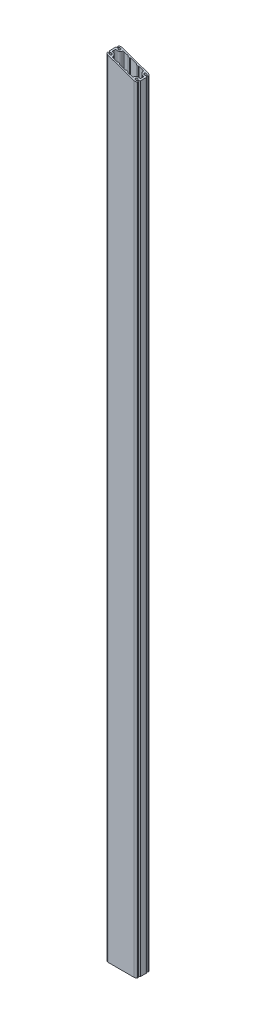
from build123d import *

# Parameters (mm, degrees)
SALIENTE_EXTRUIR1_DEPTH = 4584.8
CORTAR_EXTRUIR1_DEPTH   = 4587.381039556


with BuildPart() as part:
    # Croquis2 → Saliente-Extruir1 (new body)
    with BuildSketch(Plane(origin=(0, 0, 0), x_dir=(1, 0, 0), z_dir=(0, 1, 0))):
        with BuildLine():
            Line((90, -15.820430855), (90, 15.820430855))
            ThreePointArc((90, 15.820430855), (86.377431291, 21.479059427), (79.722019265, 20.557879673))
            ThreePointArc((79.722019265, 20.557879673), (69.104845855, 26.662756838), (81.19143785, 28.639671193))
            ThreePointArc((81.19143785, 28.639671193), (86.625966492, 27.069353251), (88.196284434, 32.503881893))
            ThreePointArc((88.196284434, 32.503881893), (82.872032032, 37.986118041), (75.5, 40))
            Line((75.5, 40), (-75.5, 40))
            ThreePointArc((-75.5, 40), (-82.872032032, 37.986118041), (-88.196284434, 32.503881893))
            ThreePointArc((-88.196284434, 32.503881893), (-86.625966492, 27.069353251), (-81.19143785, 28.639671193))
            ThreePointArc((-81.19143785, 28.639671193), (-69.104845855, 26.662756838), (-79.722019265, 20.557879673))
            ThreePointArc((-79.722019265, 20.557879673), (-86.377431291, 21.479059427), (-90, 15.820430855))
            Line((-90, 15.820430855), (-90, -15.820430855))
            ThreePointArc((-90, -15.820430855), (-86.377431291, -21.479059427), (-79.722019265, -20.557879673))
            ThreePointArc((-79.722019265, -20.557879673), (-69.104845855, -26.662756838), (-81.19143785, -28.639671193))
            ThreePointArc((-81.19143785, -28.639671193), (-86.625966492, -27.069353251), (-88.196284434, -32.503881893))
            ThreePointArc((-88.196284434, -32.503881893), (-82.872032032, -37.986118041), (-75.5, -40))
            Line((-75.5, -40), (75.5, -40))
            ThreePointArc((75.5, -40), (82.872032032, -37.986118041), (88.196284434, -32.503881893))
            ThreePointArc((88.196284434, -32.503881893), (86.625966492, -27.069353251), (81.19143785, -28.639671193))
            ThreePointArc((81.19143785, -28.639671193), (69.104845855, -26.662756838), (79.722019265, -20.557879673))
            ThreePointArc((79.722019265, -20.557879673), (86.377431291, -21.479059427), (90, -15.820430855))
        make_face()
        with BuildLine():
            Line((-17.482701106, 32), (17.482701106, 32))
            Line((17.482701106, 32), (20, 29))
            Line((20, 29), (30, 29))
            Line((30, 29), (32.517298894, 32))
            Line((32.517298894, 32), (54.5, 32))
            ThreePointArc((54.5, 32), (59.096194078, 30.096194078), (61, 25.5))
            ThreePointArc((61, 25.5), (65.246951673, 15.246951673), (75.5, 11))
            ThreePointArc((75.5, 11), (80.096194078, 9.096194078), (82, 4.5))
            Line((82, 4.5), (82, -4.5))
            ThreePointArc((82, -4.5), (80.096194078, -9.096194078), (75.5, -11))
            ThreePointArc((75.5, -11), (65.246951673, -15.246951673), (61, -25.5))
            ThreePointArc((61, -25.5), (59.096194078, -30.096194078), (54.5, -32))
            Line((54.5, -32), (32.517298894, -32))
            Line((32.517298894, -32), (30, -29))
            Line((30, -29), (20, -29))
            Line((20, -29), (17.482701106, -32))
            Line((17.482701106, -32), (-17.482701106, -32))
            Line((-17.482701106, -32), (-20, -29))
            Line((-20, -29), (-30, -29))
            Line((-30, -29), (-32.517298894, -32))
            Line((-32.517298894, -32), (-54.5, -32))
            ThreePointArc((-54.5, -32), (-59.096194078, -30.096194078), (-61, -25.5))
            ThreePointArc((-61, -25.5), (-65.246951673, -15.246951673), (-75.5, -11))
            ThreePointArc((-75.5, -11), (-80.096194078, -9.096194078), (-82, -4.5))
            Line((-82, -4.5), (-82, 4.5))
            ThreePointArc((-82, 4.5), (-80.096194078, 9.096194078), (-75.5, 11))
            ThreePointArc((-75.5, 11), (-65.246951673, 15.246951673), (-61, 25.5))
            ThreePointArc((-61, 25.5), (-59.096194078, 30.096194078), (-54.5, 32))
            Line((-54.5, 32), (-32.517298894, 32))
            Line((-32.517298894, 32), (-30, 29))
            Line((-30, 29), (-20, 29))
            Line((-20, 29), (-17.482701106, 32))
        make_face(mode=Mode.SUBTRACT)
    extrude(amount=SALIENTE_EXTRUIR1_DEPTH)

    # Croquis3 → Cortar-Extruir1 (cut, through all)
    with BuildSketch(Plane.XY.offset(40)):
        Polygon((-90, 4584.8), (90, 4584.8), (90, 4522.400000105), align=None)
    extrude(amount=-CORTAR_EXTRUIR1_DEPTH, mode=Mode.SUBTRACT)


solid = part.part
